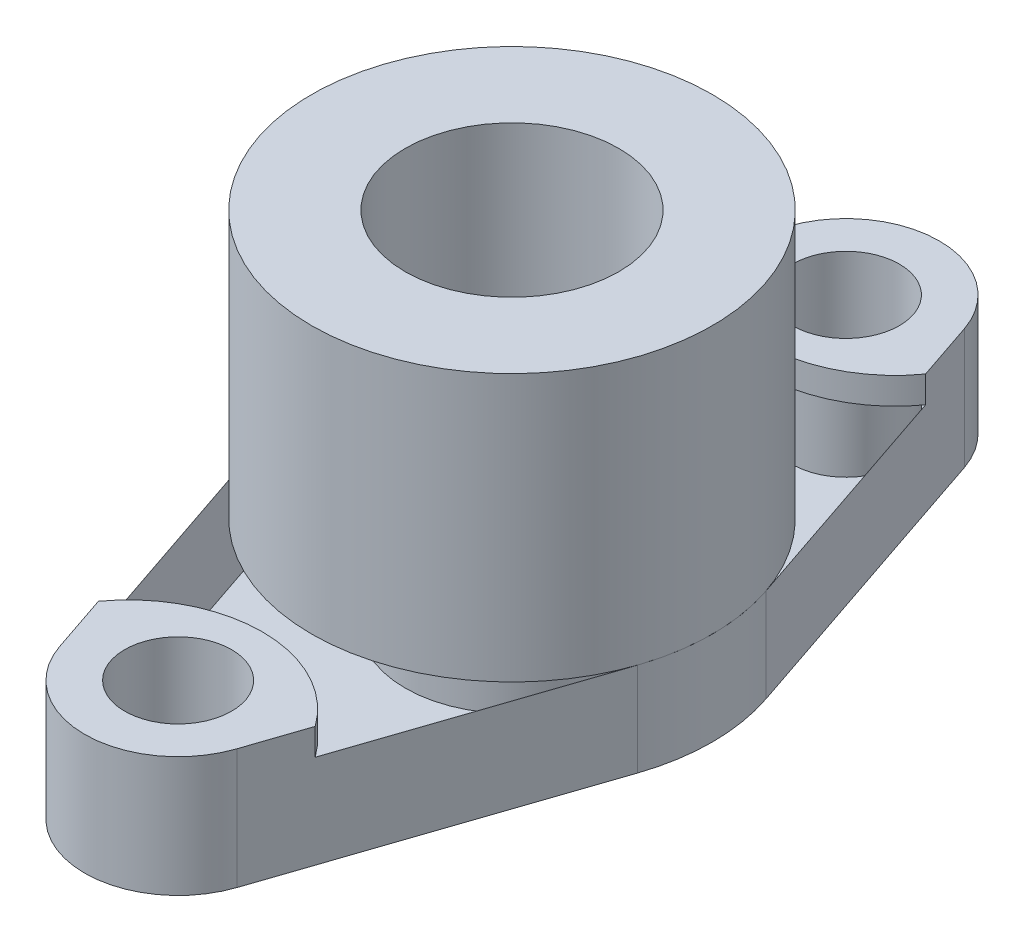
from build123d import *

# Parameters (mm, degrees)
SKETCH_1_R      = 15
SKETCH_1_R_2    = 8
EXTRUDE_1_DEPTH = 27
SKETCH_2_R      = 4
SKETCH_2_R_2    = 8
EXTRUDE_2_DEPTH = 7
SKETCH_3_R      = 4
EXTRUDE_3_DEPTH = 2


with BuildPart() as part:
    # Sketch 1 → Extrude 1 (new body)
    with BuildSketch(Plane(origin=(0, 0, 0), x_dir=(1, 0, 0), z_dir=(0, 1, 0))):
        with Locations(Location((0, 0, 0), (0, 0, 270))):
            Circle(SKETCH_1_R)
        with Locations(Location((0, 0, 0), (0, 0, 270))):
            Circle(SKETCH_1_R_2, mode=Mode.SUBTRACT)
    extrude(amount=EXTRUDE_1_DEPTH)

    # Sketch 2 → Extrude 2 (add)
    with BuildSketch(Plane.XZ):
        with BuildLine():
            Line((14.21127279, -4.800011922), (6.631921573, -27.240003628))
            ThreePointArc((6.631921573, -27.240003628), (0, -32), (-6.631921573, -27.240003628))
            Line((-6.631921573, -27.240003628), (-14.21127279, -4.800011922))
            ThreePointArc((-14.21127279, -4.800011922), (-15.000012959, 0), (-14.21127279, 4.800011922))
            Line((-14.21127279, 4.800011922), (-6.631921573, 27.240003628))
            ThreePointArc((-6.631921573, 27.240003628), (0, 32), (6.631921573, 27.240003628))
            Line((6.631921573, 27.240003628), (14.21127279, 4.800011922))
            ThreePointArc((14.21127279, 4.800011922), (15.000012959, 0), (14.21127279, -4.800011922))
        make_face()
        with Locations(Location((0, -25, 0), (0, 0, 270))):
            Circle(SKETCH_2_R, mode=Mode.SUBTRACT)
        with Locations(Location((0, 25, 0), (0, 0, 270))):
            Circle(SKETCH_2_R, mode=Mode.SUBTRACT)
        with Locations(Location((0, 0, 0), (0, 0, 90))):
            Circle(SKETCH_2_R_2, mode=Mode.SUBTRACT)
    extrude(amount=-EXTRUDE_2_DEPTH)

    # Sketch 3 → Extrude 3 (add)
    # profile 1 of 2: a face of its own
    with BuildSketch(Plane(origin=(0, 7, 0), x_dir=(-1, 0, 0), z_dir=(0, 1, 0))):
        with BuildLine():
            Line((-6.631921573, -27.240003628), (-8.114421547, -22.85080379))
            ThreePointArc((-8.114421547, -22.85080379), (0, -18.695131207), (8.114421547, -22.85080379))
            Line((8.114421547, -22.85080379), (6.631921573, -27.240003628))
            ThreePointArc((6.631921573, -27.240003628), (0, -32), (-6.631921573, -27.240003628))
        make_face()
        with Locations(Location((0, -25, 0), (0, 0, 270))):
            Circle(SKETCH_3_R, mode=Mode.SUBTRACT)
    # profile 2 of 2: a face of its own
    with BuildSketch(Plane(origin=(0, 7, 0), x_dir=(-1, 0, 0), z_dir=(0, 1, 0))):
        with BuildLine():
            Line((6.631921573, 27.240003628), (8.114421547, 22.85080379))
            ThreePointArc((8.114421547, 22.85080379), (0, 18.695131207), (-8.114421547, 22.85080379))
            Line((-8.114421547, 22.85080379), (-6.631921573, 27.240003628))
            ThreePointArc((-6.631921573, 27.240003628), (0, 32), (6.631921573, 27.240003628))
        make_face()
        with Locations(Location((0, 25, 0), (0, 0, 270))):
            Circle(SKETCH_3_R, mode=Mode.SUBTRACT)
    extrude(amount=EXTRUDE_3_DEPTH)


solid = part.part
